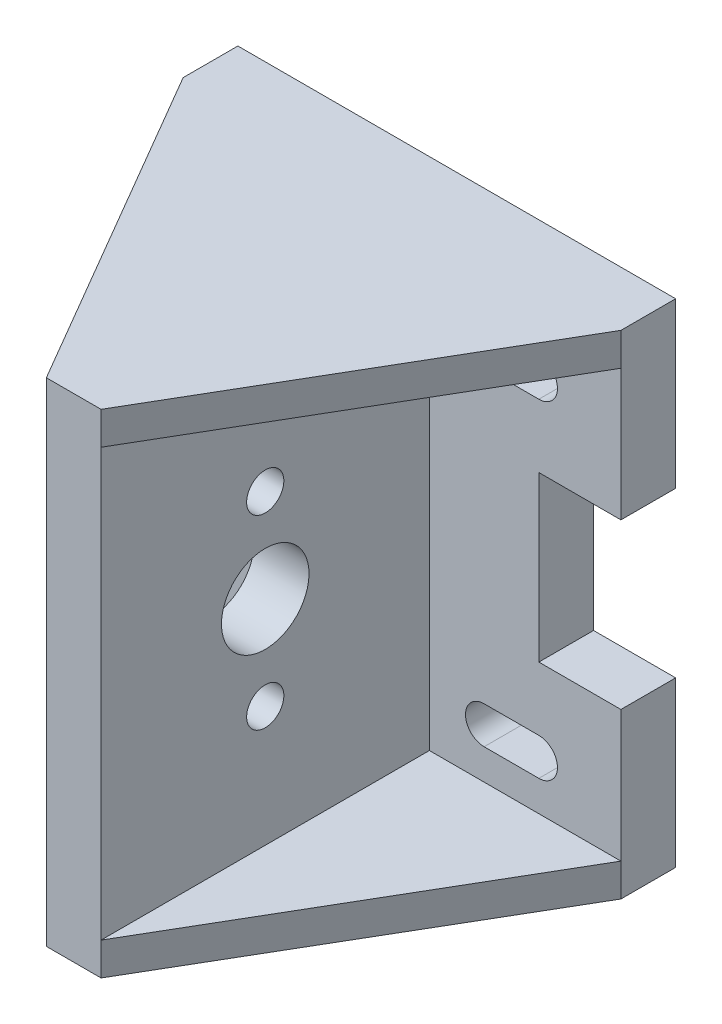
from build123d import *

# Parameters (mm, degrees)
SKETCH_1_W              = 40
SKETCH_1_H              = 45
EXTRUDE_1_DEPTH         = 5
SKETCH_2_W              = 5
SKETCH_2_H              = 45
EXTRUDE_2_DEPTH         = 30
SKETCH_4_R              = 4
CUT_EXTRUDE_1_DEPTH     = 48.302219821
HOLE_WIZARD_3_4_3_4_1_D = 3.4
HOLE_WIZARD_3_4_3_4_2_D = 3.4
EXTRUDE_4_DEPTH         = 3
SKETCH_10_W             = 15
SKETCH_10_H             = 15
CUT_EXTRUDE_2_DEPTH     = 43.5
CUT_EXTRUDE_3_DEPTH     = 43.5


with BuildPart() as part:
    # Sketch 1 → Extrude 1 (new body)
    with BuildSketch(Plane.XY):
        Rectangle(SKETCH_1_W, SKETCH_1_H)
    extrude(amount=EXTRUDE_1_DEPTH)

    # Sketch 2 → Extrude 2 (add)
    with BuildSketch(Plane.XY.offset(5)):
        Rectangle(SKETCH_2_W, SKETCH_2_H)
    extrude(amount=EXTRUDE_2_DEPTH)

    # Sketch 4 → Cut-Extrude 1 (cut, through all)
    with BuildSketch(Plane(origin=(2.5, 0, 0), x_dir=(0, 0, -1), z_dir=(1, 0, 0))):
        with Locations(Location((-20, 0, 0), (0, 0, 90))):
            Circle(SKETCH_4_R)
    extrude(amount=-CUT_EXTRUDE_1_DEPTH, mode=Mode.SUBTRACT)

    # Hole Wizard 3.4 _3.4_ _1 (through all)
    with Locations(Plane.ZY.offset(20)):
        with Locations((20, -8.5), (20, 8.5)):
            Hole(HOLE_WIZARD_3_4_3_4_1_D / 2)

    # Hole Wizard 3.4 _3.4_ _2 (through all)
    with Locations(Plane.XY.offset(5)):
        with Locations((10, 15), (-10, 15), (10, -15), (-10, -15)):
            Hole(HOLE_WIZARD_3_4_3_4_2_D / 2)

    # Sketch 9 → Extrude 4 (add)
    with BuildSketch(Plane(origin=(0, 22.5, 0), x_dir=(1, 0, 0), z_dir=(0, 1, 0))):
        Polygon((-20, -5), (-2.5, -5), (-2.5, -35), align=None)
        Polygon((2.5, -5), (2.5, -35), (20, -5), align=None)
    extrude_4 = extrude(amount=-EXTRUDE_4_DEPTH)

    # Mirror 2: Extrude 4 across plane
    add(extrude_4.mirror(Plane.ZX))

    # Sketch 10 → Cut-Extrude 2 (cut, through all)
    with BuildSketch(Plane.XY.offset(5)):
        with Locations((-20, 0)):
            Rectangle(SKETCH_10_W, SKETCH_10_H)
    cut_extrude_2 = extrude(amount=-CUT_EXTRUDE_2_DEPTH, mode=Mode.SUBTRACT)

    # Sketch 11 → Cut-Extrude 3 (cut, through all)
    with BuildSketch(Plane.XY.offset(5)):
        with BuildLine():
            Line((-12.5, 16.7), (-7.5, 16.7))
            ThreePointArc((-7.5, 16.7), (-5.8, 15), (-7.5, 13.3))
            Line((-7.5, 13.3), (-12.5, 13.3))
            ThreePointArc((-12.5, 13.3), (-14.2, 15), (-12.5, 16.7))
        make_face()
        with BuildLine():
            Line((7.5, 16.7), (12.5, 16.7))
            ThreePointArc((12.5, 16.7), (14.2, 15), (12.5, 13.3))
            Line((12.5, 13.3), (7.5, 13.3))
            ThreePointArc((7.5, 13.3), (5.8, 15), (7.5, 16.7))
        make_face()
        with BuildLine():
            Line((-12.5, -13.3), (-7.5, -13.3))
            ThreePointArc((-7.5, -13.3), (-5.8, -15), (-7.5, -16.7))
            Line((-7.5, -16.7), (-12.5, -16.7))
            ThreePointArc((-12.5, -16.7), (-14.2, -15), (-12.5, -13.3))
        make_face()
        with BuildLine():
            Line((7.5, -13.3), (12.5, -13.3))
            ThreePointArc((12.5, -13.3), (14.2, -15), (12.5, -16.7))
            Line((12.5, -16.7), (7.5, -16.7))
            ThreePointArc((7.5, -16.7), (5.8, -15), (7.5, -13.3))
        make_face()
    extrude(amount=-CUT_EXTRUDE_3_DEPTH, mode=Mode.SUBTRACT)

    # Mirror 3: Cut-Extrude 2 across plane
    add(cut_extrude_2.mirror(Plane(origin=(0, 0, 0), x_dir=(0, 0, 1), z_dir=(1, 0, 0))), mode=Mode.SUBTRACT)


solid = part.part
